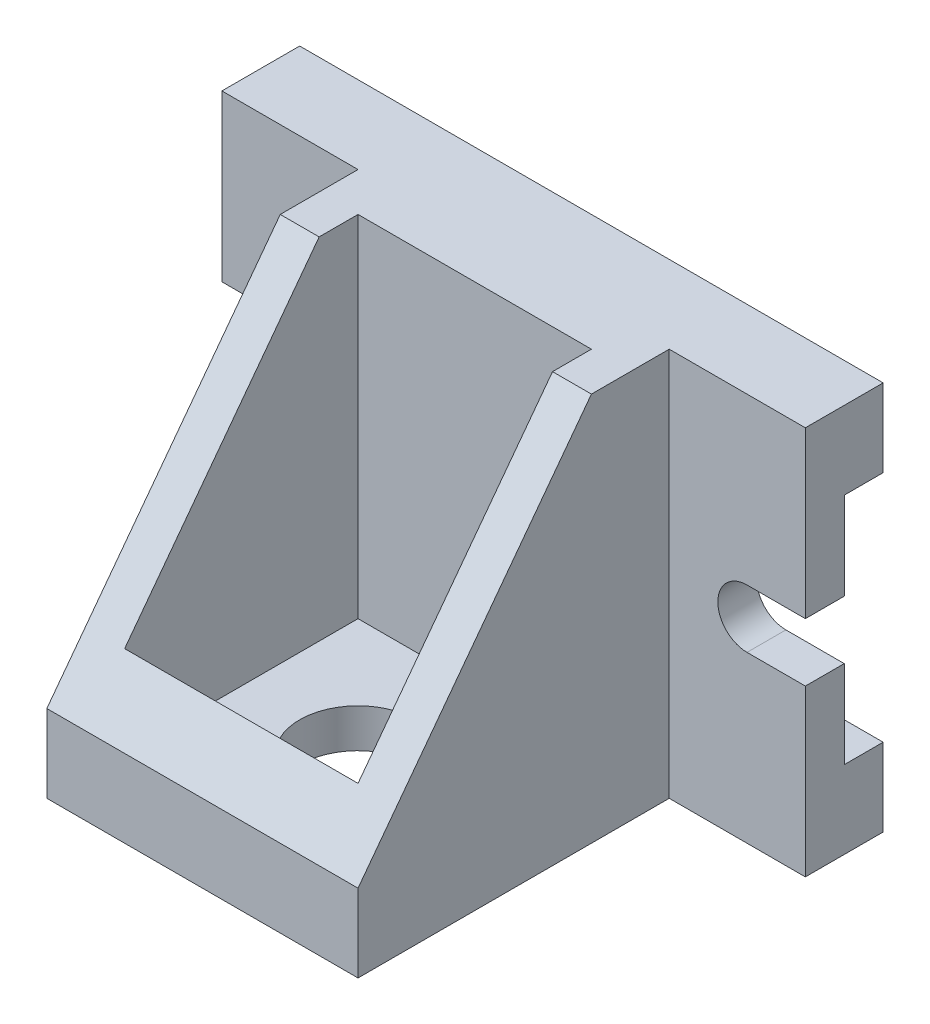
from build123d import *

# Parameters (mm, degrees)
SALIENTE_EXTRUIR1_DEPTH    = 20
CORTAR_EXTRUIR1_DEPTH      = 160.373774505
CORTAR_EXTRUIR1_DEPTH_BACK = 160.373774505
CROQUIS3_W                 = 10
CROQUIS3_H                 = 60
SALIENTE_EXTRUIR2_DEPTH    = 150
CORTAR_EXTRUIR2_DEPTH      = 188.082869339
CORTAR_EXTRUIR2_DEPTH_BACK = 35
CROQUIS6_W                 = 80
CROQUIS6_H                 = 100
CROQUIS7_W                 = 80
CROQUIS7_H                 = 100
CORTAR_EXTRUIR3_DEPTH      = 35
CROQUIS8_W                 = 60
CROQUIS8_H                 = 60
CORTAR_EXTRUIR4_DEPTH      = 90
CROQUIS9_R                 = 15
CORTAR_EXTRUIR5_DEPTH      = 161.078105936


with BuildPart() as part:
    # Croquis2 → Saliente-Extruir1 (new body)
    with BuildSketch(Plane.XY):
        with BuildLine():
            Line((-75, 50), (75, 50))
            Line((75, 50), (75, 7.5))
            Line((75, 7.5), (60, 7.5))
            ThreePointArc((60, 7.5), (52.5, 0), (60, -7.5))
            Line((60, -7.5), (75, -7.5))
            Line((75, -7.5), (75, -50))
            Line((75, -50), (-75, -50))
            Line((-75, -50), (-75, -7.5))
            Line((-75, -7.5), (-60, -7.5))
            ThreePointArc((-60, -7.5), (-52.5, 0), (-60, 7.5))
            Line((-60, 7.5), (-75, 7.5))
            Line((-75, 7.5), (-75, 50))
        make_face()
    extrude(amount=SALIENTE_EXTRUIR1_DEPTH)

    # Croquis3 → Cortar-Extruir1 (cut, two sides: drawn at the far end of the back side and taken through both)
    with BuildSketch(Plane.ZY.offset(75).offset(-CORTAR_EXTRUIR1_DEPTH_BACK)):
        with Locations((5, 0)):
            Rectangle(CROQUIS3_W, CROQUIS3_H)
    extrude(amount=CORTAR_EXTRUIR1_DEPTH + CORTAR_EXTRUIR1_DEPTH_BACK, mode=Mode.SUBTRACT)

    # Croquis5 → Saliente-Extruir2 (add, through all)
    with BuildSketch(Plane(origin=(75, 0, 0), x_dir=(0, 0, -1), z_dir=(1, 0, 0))):
        Polygon((-40, 50), (-20, 50), (-20, -50), (-40, -50), (-100, -50), (-100, -30), align=None)
    extrude(amount=-SALIENTE_EXTRUIR2_DEPTH)

    # Croquis6 → Cortar-Extruir2 (cut, two sides: drawn at the far end of the back side and taken through both)
    with BuildSketch(Plane(origin=(75, 0, 0), x_dir=(0, 0, -1), z_dir=(1, 0, 0)).offset(-CORTAR_EXTRUIR2_DEPTH_BACK)):
        with Locations((-60, 0)):
            Rectangle(CROQUIS6_W, CROQUIS6_H)
    extrude(amount=CORTAR_EXTRUIR2_DEPTH + CORTAR_EXTRUIR2_DEPTH_BACK, mode=Mode.SUBTRACT)

    # Croquis7 → Cortar-Extruir3 (cut)
    with BuildSketch(Plane.ZY.offset(75)):
        with Locations((60, 0)):
            Rectangle(CROQUIS7_W, CROQUIS7_H)
    extrude(amount=-CORTAR_EXTRUIR3_DEPTH, mode=Mode.SUBTRACT)

    # Croquis8 → Cortar-Extruir4 (cut)
    with BuildSketch(Plane(origin=(0, 50, 0), x_dir=(1, 0, 0), z_dir=(0, 1, 0))):
        with Locations((0, -60)):
            Rectangle(CROQUIS8_W, CROQUIS8_H)
    extrude(amount=-CORTAR_EXTRUIR4_DEPTH, mode=Mode.SUBTRACT)

    # Croquis9 → Cortar-Extruir5 (cut, through all)
    with BuildSketch(Plane(origin=(0, 50, 0), x_dir=(1, 0, 0), z_dir=(0, 1, 0))):
        with Locations(Location((0, -60, 0), (0, 0, 270))):
            Circle(CROQUIS9_R)
    extrude(amount=-CORTAR_EXTRUIR5_DEPTH, mode=Mode.SUBTRACT)


solid = part.part
